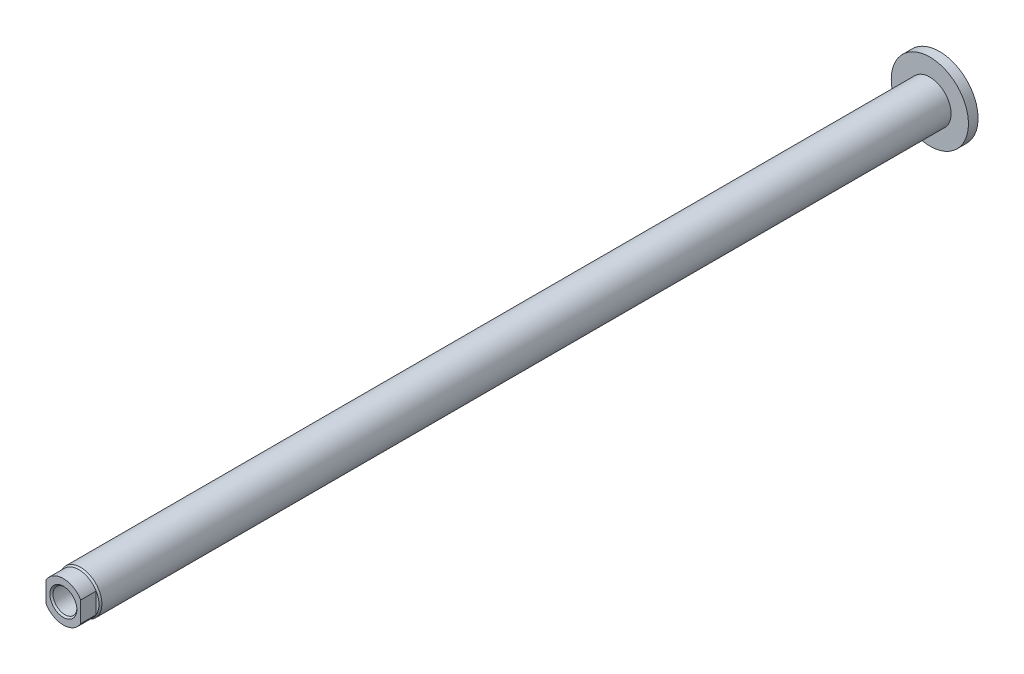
ISO-10303-21;
HEADER;
FILE_DESCRIPTION(('STEP AP214'),'2;1');
FILE_NAME('part.step','',(''),(''),'','','');
FILE_SCHEMA(('AUTOMOTIVE_DESIGN { 1 0 10303 214 1 1 1 1 }'));
ENDSEC;
DATA;
#1=APPLICATION_CONTEXT('core data for automotive mechanical design processes');
#2=APPLICATION_PROTOCOL_DEFINITION('international standard','automotive_design',2000,#1);
#3=PRODUCT_CONTEXT('',#1,'mechanical');
#4=PRODUCT('Part','Part','',(#3));
#5=PRODUCT_RELATED_PRODUCT_CATEGORY('part','',(#4));
#6=PRODUCT_DEFINITION_FORMATION('','',#4);
#7=PRODUCT_DEFINITION_CONTEXT('part definition',#1,'design');
#8=PRODUCT_DEFINITION('design','',#6,#7);
#9=PRODUCT_DEFINITION_SHAPE('','',#8);
#10=(LENGTH_UNIT() NAMED_UNIT(*) SI_UNIT(.MILLI.,.METRE.));
#11=(NAMED_UNIT(*) PLANE_ANGLE_UNIT() SI_UNIT($,.RADIAN.));
#12=(NAMED_UNIT(*) SI_UNIT($,.STERADIAN.) SOLID_ANGLE_UNIT());
#13=UNCERTAINTY_MEASURE_WITH_UNIT(LENGTH_MEASURE(1.E-05),#10,'distance_accuracy_value','');
#14=(GEOMETRIC_REPRESENTATION_CONTEXT(3) GLOBAL_UNCERTAINTY_ASSIGNED_CONTEXT((#13)) GLOBAL_UNIT_ASSIGNED_CONTEXT((#10,
#11,#12)) REPRESENTATION_CONTEXT('',''));
#15=CARTESIAN_POINT('',(0.,0.,0.));
#16=DIRECTION('',(0.,0.,1.));
#17=DIRECTION('',(1.,0.,0.));
#18=AXIS2_PLACEMENT_3D('',#15,#16,#17);
#19=CARTESIAN_POINT('',(0.,5.5,-435.));
#20=DIRECTION('',(0.,0.,-1.));
#21=DIRECTION('',(0.,1.,0.));
#22=AXIS2_PLACEMENT_3D('',#19,#20,#21);
#23=PLANE('',#22);
#24=CARTESIAN_POINT('',(0.,0.,-435.));
#25=DIRECTION('',(0.,0.,-1.));
#26=DIRECTION('',(-1.,0.,0.));
#27=AXIS2_PLACEMENT_3D('',#24,#25,#26);
#28=CIRCLE('',#27,20.);
#29=CARTESIAN_POINT('',(-20.,0.,-435.));
#30=VERTEX_POINT('',#29);
#31=EDGE_CURVE('E153',#30,#30,#28,.T.);
#32=ORIENTED_EDGE('',*,*,#31,.T.);
#33=EDGE_LOOP('',(#32));
#34=FACE_BOUND('',#33,.T.);
#35=ADVANCED_FACE('F15',(#34),#23,.T.);
#36=CARTESIAN_POINT('',(0.,0.,-212.476313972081));
#37=DIRECTION('',(0.,0.,1.));
#38=DIRECTION('',(0.,1.,0.));
#39=AXIS2_PLACEMENT_3D('',#36,#37,#38);
#40=CYLINDRICAL_SURFACE('',#39,11.);
#41=CARTESIAN_POINT('',(0.,0.,10.0473720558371));
#42=DIRECTION('',(0.,0.,-1.));
#43=DIRECTION('',(0.,1.,0.));
#44=AXIS2_PLACEMENT_3D('',#41,#42,#43);
#45=CIRCLE('',#44,11.);
#46=CARTESIAN_POINT('',(0.,11.,10.0473720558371));
#47=VERTEX_POINT('',#46);
#48=EDGE_CURVE('E10',#47,#47,#45,.T.);
#49=ORIENTED_EDGE('',*,*,#48,.T.);
#50=EDGE_LOOP('',(#49));
#51=FACE_BOUND('',#50,.T.);
#52=CARTESIAN_POINT('',(0.,0.,-430.));
#53=DIRECTION('',(0.,0.,1.));
#54=DIRECTION('',(0.,1.,0.));
#55=AXIS2_PLACEMENT_3D('',#52,#53,#54);
#56=CIRCLE('',#55,11.);
#57=CARTESIAN_POINT('',(0.,-11.,-430.));
#58=VERTEX_POINT('',#57);
#59=EDGE_CURVE('E178',#58,#58,#56,.T.);
#60=ORIENTED_EDGE('',*,*,#59,.T.);
#61=EDGE_LOOP('',(#60));
#62=FACE_BOUND('',#61,.T.);
#63=ADVANCED_FACE('F108',(#51,#62),#40,.T.);
#64=CARTESIAN_POINT('',(0.,0.,10.5236860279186));
#65=DIRECTION('',(0.,0.,-1.));
#66=DIRECTION('',(0.,1.,0.));
#67=AXIS2_PLACEMENT_3D('',#64,#65,#66);
#68=CONICAL_SURFACE('',#67,10.725,0.523598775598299);
#69=CARTESIAN_POINT('',(0.,0.,11.));
#70=DIRECTION('',(0.,0.,-1.));
#71=DIRECTION('',(0.,1.,0.));
#72=AXIS2_PLACEMENT_3D('',#69,#70,#71);
#73=CIRCLE('',#72,10.45);
#74=CARTESIAN_POINT('',(9.,-5.31060260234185,11.));
#75=VERTEX_POINT('',#74);
#76=CARTESIAN_POINT('',(-9.,-5.31060260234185,11.));
#77=VERTEX_POINT('',#76);
#78=EDGE_CURVE('E25',#75,#77,#73,.T.);
#79=ORIENTED_EDGE('',*,*,#78,.T.);
#80=CARTESIAN_POINT('',(0.,0.,11.));
#81=DIRECTION('',(0.,0.,-1.));
#82=DIRECTION('',(0.,1.,0.));
#83=AXIS2_PLACEMENT_3D('',#80,#81,#82);
#84=CIRCLE('',#83,10.45);
#85=CARTESIAN_POINT('',(-9.,5.31060260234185,11.));
#86=VERTEX_POINT('',#85);
#87=EDGE_CURVE('E181',#77,#86,#84,.T.);
#88=ORIENTED_EDGE('',*,*,#87,.T.);
#89=CARTESIAN_POINT('',(0.,0.,11.));
#90=DIRECTION('',(0.,0.,-1.));
#91=DIRECTION('',(0.,1.,0.));
#92=AXIS2_PLACEMENT_3D('',#89,#90,#91);
#93=CIRCLE('',#92,10.45);
#94=CARTESIAN_POINT('',(9.,5.31060260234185,11.));
#95=VERTEX_POINT('',#94);
#96=EDGE_CURVE('E143',#86,#95,#93,.T.);
#97=ORIENTED_EDGE('',*,*,#96,.T.);
#98=CARTESIAN_POINT('',(0.,0.,11.));
#99=DIRECTION('',(0.,0.,-1.));
#100=DIRECTION('',(0.,1.,0.));
#101=AXIS2_PLACEMENT_3D('',#98,#99,#100);
#102=CIRCLE('',#101,10.45);
#103=EDGE_CURVE('E165',#95,#75,#102,.T.);
#104=ORIENTED_EDGE('',*,*,#103,.T.);
#105=EDGE_LOOP('',(#79,#88,#97,#104));
#106=FACE_BOUND('',#105,.T.);
#107=ORIENTED_EDGE('',*,*,#48,.F.);
#108=EDGE_LOOP('',(#107));
#109=FACE_BOUND('',#108,.T.);
#110=ADVANCED_FACE('F114',(#106,#109),#68,.T.);
#111=CARTESIAN_POINT('',(0.,0.,15.));
#112=DIRECTION('',(0.,0.,1.));
#113=DIRECTION('',(0.,1.,0.));
#114=AXIS2_PLACEMENT_3D('',#111,#112,#113);
#115=CYLINDRICAL_SURFACE('',#114,10.45);
#116=DIRECTION('',(0.,0.,-1.));
#117=VECTOR('',#116,1.);
#118=CARTESIAN_POINT('',(-9.,-5.31060260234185,15.));
#119=LINE('',#118,#117);
#120=CARTESIAN_POINT('',(-9.,-5.31060260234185,19.));
#121=VERTEX_POINT('',#120);
#122=EDGE_CURVE('E19',#121,#77,#119,.T.);
#123=ORIENTED_EDGE('',*,*,#122,.T.);
#124=ORIENTED_EDGE('',*,*,#78,.F.);
#125=DIRECTION('',(0.,0.,1.));
#126=VECTOR('',#125,1.);
#127=CARTESIAN_POINT('',(9.,-5.31060260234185,15.));
#128=LINE('',#127,#126);
#129=CARTESIAN_POINT('',(9.,-5.31060260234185,19.));
#130=VERTEX_POINT('',#129);
#131=EDGE_CURVE('E179',#75,#130,#128,.T.);
#132=ORIENTED_EDGE('',*,*,#131,.T.);
#133=CARTESIAN_POINT('',(0.,0.,19.));
#134=DIRECTION('',(0.,0.,-1.));
#135=DIRECTION('',(0.,1.,0.));
#136=AXIS2_PLACEMENT_3D('',#133,#134,#135);
#137=CIRCLE('',#136,10.45);
#138=EDGE_CURVE('E56',#130,#121,#137,.T.);
#139=ORIENTED_EDGE('',*,*,#138,.T.);
#140=EDGE_LOOP('',(#123,#124,#132,#139));
#141=FACE_BOUND('',#140,.T.);
#142=ADVANCED_FACE('F102',(#141),#115,.T.);
#143=CARTESIAN_POINT('',(0.,5.225,19.));
#144=DIRECTION('',(0.,0.,1.));
#145=DIRECTION('',(0.,-1.,0.));
#146=AXIS2_PLACEMENT_3D('',#143,#144,#145);
#147=PLANE('',#146);
#148=CARTESIAN_POINT('',(0.,0.,19.));
#149=DIRECTION('',(0.,0.,-1.));
#150=DIRECTION('',(0.,1.,0.));
#151=AXIS2_PLACEMENT_3D('',#148,#149,#150);
#152=CIRCLE('',#151,7.);
#153=CARTESIAN_POINT('',(0.,7.,19.));
#154=VERTEX_POINT('',#153);
#155=EDGE_CURVE('E166',#154,#154,#152,.T.);
#156=ORIENTED_EDGE('',*,*,#155,.T.);
#157=EDGE_LOOP('',(#156));
#158=FACE_BOUND('',#157,.T.);
#159=DIRECTION('',(0.,-1.,0.));
#160=VECTOR('',#159,1.);
#161=CARTESIAN_POINT('',(-9.,2.6125,19.));
#162=LINE('',#161,#160);
#163=CARTESIAN_POINT('',(-9.,5.31060260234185,19.));
#164=VERTEX_POINT('',#163);
#165=EDGE_CURVE('E146',#164,#121,#162,.T.);
#166=ORIENTED_EDGE('',*,*,#165,.T.);
#167=ORIENTED_EDGE('',*,*,#138,.F.);
#168=DIRECTION('',(0.,1.,0.));
#169=VECTOR('',#168,1.);
#170=CARTESIAN_POINT('',(9.,2.6125,19.));
#171=LINE('',#170,#169);
#172=CARTESIAN_POINT('',(9.,5.31060260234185,19.));
#173=VERTEX_POINT('',#172);
#174=EDGE_CURVE('E164',#130,#173,#171,.T.);
#175=ORIENTED_EDGE('',*,*,#174,.T.);
#176=CARTESIAN_POINT('',(0.,0.,19.));
#177=DIRECTION('',(0.,0.,-1.));
#178=DIRECTION('',(0.,1.,0.));
#179=AXIS2_PLACEMENT_3D('',#176,#177,#178);
#180=CIRCLE('',#179,10.45);
#181=EDGE_CURVE('E45',#164,#173,#180,.T.);
#182=ORIENTED_EDGE('',*,*,#181,.F.);
#183=EDGE_LOOP('',(#166,#167,#175,#182));
#184=FACE_BOUND('',#183,.T.);
#185=ADVANCED_FACE('F17',(#158,#184),#147,.T.);
#186=CARTESIAN_POINT('',(0.,0.,-10.2863578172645));
#187=DIRECTION('',(0.,0.,1.));
#188=DIRECTION('',(0.,1.,0.));
#189=AXIS2_PLACEMENT_3D('',#186,#187,#188);
#190=CONICAL_SURFACE('',#189,3.0940625,1.0471975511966);
#191=CARTESIAN_POINT('',(0.,0.,-8.5));
#192=DIRECTION('',(0.,0.,-1.));
#193=DIRECTION('',(0.,1.,0.));
#194=AXIS2_PLACEMENT_3D('',#191,#192,#193);
#195=CIRCLE('',#194,6.188125);
#196=CARTESIAN_POINT('',(0.,6.188125,-8.5));
#197=VERTEX_POINT('',#196);
#198=EDGE_CURVE('E159',#197,#197,#195,.T.);
#199=ORIENTED_EDGE('',*,*,#198,.F.);
#200=EDGE_LOOP('',(#199));
#201=FACE_BOUND('',#200,.T.);
#202=CARTESIAN_POINT('',(0.,0.,-12.0727156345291));
#203=VERTEX_POINT('',#202);
#204=VERTEX_LOOP('',#203);
#205=FACE_BOUND('',#204,.T.);
#206=ADVANCED_FACE('F89',(#201,#205),#190,.F.);
#207=CARTESIAN_POINT('',(0.,0.,-7.6559375));
#208=DIRECTION('',(0.,0.,1.));
#209=DIRECTION('',(0.,1.,0.));
#210=AXIS2_PLACEMENT_3D('',#207,#208,#209);
#211=CYLINDRICAL_SURFACE('',#210,6.188125);
#212=CARTESIAN_POINT('',(0.,0.,-6.811875));
#213=DIRECTION('',(0.,0.,-1.));
#214=DIRECTION('',(0.,1.,0.));
#215=AXIS2_PLACEMENT_3D('',#212,#213,#214);
#216=CIRCLE('',#215,6.188125);
#217=CARTESIAN_POINT('',(0.,6.188125,-6.811875));
#218=VERTEX_POINT('',#217);
#219=EDGE_CURVE('E156',#218,#218,#216,.T.);
#220=ORIENTED_EDGE('',*,*,#219,.F.);
#221=EDGE_LOOP('',(#220));
#222=FACE_BOUND('',#221,.T.);
#223=ORIENTED_EDGE('',*,*,#198,.T.);
#224=EDGE_LOOP('',(#223));
#225=FACE_BOUND('',#224,.T.);
#226=ADVANCED_FACE('F91',(#222,#225),#211,.F.);
#227=CARTESIAN_POINT('',(0.,0.,-6.4059375));
#228=DIRECTION('',(0.,0.,1.));
#229=DIRECTION('',(0.,1.,0.));
#230=AXIS2_PLACEMENT_3D('',#227,#228,#229);
#231=CONICAL_SURFACE('',#230,6.5940625,0.785398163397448);
#232=CARTESIAN_POINT('',(0.,0.,-6.));
#233=DIRECTION('',(0.,0.,-1.));
#234=DIRECTION('',(0.,1.,0.));
#235=AXIS2_PLACEMENT_3D('',#232,#233,#234);
#236=CIRCLE('',#235,7.);
#237=CARTESIAN_POINT('',(0.,7.,-6.));
#238=VERTEX_POINT('',#237);
#239=EDGE_CURVE('E154',#238,#238,#236,.T.);
#240=ORIENTED_EDGE('',*,*,#239,.F.);
#241=EDGE_LOOP('',(#240));
#242=FACE_BOUND('',#241,.T.);
#243=ORIENTED_EDGE('',*,*,#219,.T.);
#244=EDGE_LOOP('',(#243));
#245=FACE_BOUND('',#244,.T.);
#246=ADVANCED_FACE('F99',(#242,#245),#231,.F.);
#247=CARTESIAN_POINT('',(0.,6.5940625,-6.));
#248=DIRECTION('',(0.,0.,1.));
#249=DIRECTION('',(0.,-1.,0.));
#250=AXIS2_PLACEMENT_3D('',#247,#248,#249);
#251=PLANE('',#250);
#252=CARTESIAN_POINT('',(0.,0.,-6.));
#253=DIRECTION('',(0.,0.,-1.));
#254=DIRECTION('',(0.,1.,0.));
#255=AXIS2_PLACEMENT_3D('',#252,#253,#254);
#256=CIRCLE('',#255,6.188125);
#257=CARTESIAN_POINT('',(0.,6.188125,-6.));
#258=VERTEX_POINT('',#257);
#259=EDGE_CURVE('E157',#258,#258,#256,.T.);
#260=ORIENTED_EDGE('',*,*,#259,.F.);
#261=EDGE_LOOP('',(#260));
#262=FACE_BOUND('',#261,.T.);
#263=ORIENTED_EDGE('',*,*,#239,.T.);
#264=EDGE_LOOP('',(#263));
#265=FACE_BOUND('',#264,.T.);
#266=ADVANCED_FACE('F120',(#262,#265),#251,.F.);
#267=CARTESIAN_POINT('',(0.,0.,6.0940625));
#268=DIRECTION('',(0.,0.,1.));
#269=DIRECTION('',(0.,1.,0.));
#270=AXIS2_PLACEMENT_3D('',#267,#268,#269);
#271=CYLINDRICAL_SURFACE('',#270,6.188125);
#272=CARTESIAN_POINT('',(0.,0.,18.188125));
#273=DIRECTION('',(0.,0.,-1.));
#274=DIRECTION('',(0.,1.,0.));
#275=AXIS2_PLACEMENT_3D('',#272,#273,#274);
#276=CIRCLE('',#275,6.188125);
#277=CARTESIAN_POINT('',(0.,6.188125,18.188125));
#278=VERTEX_POINT('',#277);
#279=EDGE_CURVE('E168',#278,#278,#276,.T.);
#280=ORIENTED_EDGE('',*,*,#279,.F.);
#281=EDGE_LOOP('',(#280));
#282=FACE_BOUND('',#281,.T.);
#283=ORIENTED_EDGE('',*,*,#259,.T.);
#284=EDGE_LOOP('',(#283));
#285=FACE_BOUND('',#284,.T.);
#286=ADVANCED_FACE('F122',(#282,#285),#271,.F.);
#287=CARTESIAN_POINT('',(0.,0.,18.5940625));
#288=DIRECTION('',(0.,0.,1.));
#289=DIRECTION('',(0.,1.,0.));
#290=AXIS2_PLACEMENT_3D('',#287,#288,#289);
#291=CONICAL_SURFACE('',#290,6.5940625,0.785398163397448);
#292=ORIENTED_EDGE('',*,*,#155,.F.);
#293=EDGE_LOOP('',(#292));
#294=FACE_BOUND('',#293,.T.);
#295=ORIENTED_EDGE('',*,*,#279,.T.);
#296=EDGE_LOOP('',(#295));
#297=FACE_BOUND('',#296,.T.);
#298=ADVANCED_FACE('F220',(#294,#297),#291,.F.);
#299=CARTESIAN_POINT('',(0.,0.,-432.5));
#300=DIRECTION('',(0.,0.,1.));
#301=DIRECTION('',(-1.,0.,0.));
#302=AXIS2_PLACEMENT_3D('',#299,#300,#301);
#303=CYLINDRICAL_SURFACE('',#302,20.);
#304=ORIENTED_EDGE('',*,*,#31,.F.);
#305=EDGE_LOOP('',(#304));
#306=FACE_BOUND('',#305,.T.);
#307=CARTESIAN_POINT('',(0.,0.,-430.));
#308=DIRECTION('',(0.,0.,1.));
#309=DIRECTION('',(-1.,0.,0.));
#310=AXIS2_PLACEMENT_3D('',#307,#308,#309);
#311=CIRCLE('',#310,20.);
#312=CARTESIAN_POINT('',(-20.,0.,-430.));
#313=VERTEX_POINT('',#312);
#314=EDGE_CURVE('E176',#313,#313,#311,.T.);
#315=ORIENTED_EDGE('',*,*,#314,.F.);
#316=EDGE_LOOP('',(#315));
#317=FACE_BOUND('',#316,.T.);
#318=ADVANCED_FACE('F204',(#306,#317),#303,.T.);
#319=CARTESIAN_POINT('',(0.,0.,-430.));
#320=DIRECTION('',(0.,0.,1.));
#321=DIRECTION('',(1.,0.,0.));
#322=AXIS2_PLACEMENT_3D('',#319,#320,#321);
#323=PLANE('',#322);
#324=ORIENTED_EDGE('',*,*,#59,.F.);
#325=EDGE_LOOP('',(#324));
#326=FACE_BOUND('',#325,.T.);
#327=ORIENTED_EDGE('',*,*,#314,.T.);
#328=EDGE_LOOP('',(#327));
#329=FACE_BOUND('',#328,.T.);
#330=ADVANCED_FACE('F199',(#326,#329),#323,.T.);
#331=CARTESIAN_POINT('',(9.,0.,15.5));
#332=DIRECTION('',(1.,0.,0.));
#333=DIRECTION('',(0.,0.,-1.));
#334=AXIS2_PLACEMENT_3D('',#331,#332,#333);
#335=PLANE('',#334);
#336=DIRECTION('',(0.,0.,-1.));
#337=VECTOR('',#336,1.);
#338=CARTESIAN_POINT('',(9.,5.31060260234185,15.));
#339=LINE('',#338,#337);
#340=EDGE_CURVE('E169',#173,#95,#339,.T.);
#341=ORIENTED_EDGE('',*,*,#340,.F.);
#342=ORIENTED_EDGE('',*,*,#174,.F.);
#343=ORIENTED_EDGE('',*,*,#131,.F.);
#344=DIRECTION('',(0.,-1.,0.));
#345=VECTOR('',#344,1.);
#346=CARTESIAN_POINT('',(9.,0.,11.));
#347=LINE('',#346,#345);
#348=EDGE_CURVE('E161',#95,#75,#347,.T.);
#349=ORIENTED_EDGE('',*,*,#348,.F.);
#350=EDGE_LOOP('',(#341,#342,#343,#349));
#351=FACE_BOUND('',#350,.T.);
#352=ADVANCED_FACE('F135',(#351),#335,.T.);
#353=CARTESIAN_POINT('',(20.,0.,11.));
#354=DIRECTION('',(0.,0.,1.));
#355=DIRECTION('',(1.,0.,0.));
#356=AXIS2_PLACEMENT_3D('',#353,#354,#355);
#357=PLANE('',#356);
#358=ORIENTED_EDGE('',*,*,#103,.F.);
#359=ORIENTED_EDGE('',*,*,#348,.T.);
#360=EDGE_LOOP('',(#358,#359));
#361=FACE_BOUND('',#360,.T.);
#362=ADVANCED_FACE('F127',(#361),#357,.T.);
#363=CARTESIAN_POINT('',(0.,0.,15.));
#364=DIRECTION('',(0.,0.,1.));
#365=DIRECTION('',(0.,1.,0.));
#366=AXIS2_PLACEMENT_3D('',#363,#364,#365);
#367=CYLINDRICAL_SURFACE('',#366,10.45);
#368=DIRECTION('',(0.,0.,1.));
#369=VECTOR('',#368,1.);
#370=CARTESIAN_POINT('',(-9.,5.31060260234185,15.));
#371=LINE('',#370,#369);
#372=EDGE_CURVE('E139',#86,#164,#371,.T.);
#373=ORIENTED_EDGE('',*,*,#372,.T.);
#374=ORIENTED_EDGE('',*,*,#181,.T.);
#375=ORIENTED_EDGE('',*,*,#340,.T.);
#376=ORIENTED_EDGE('',*,*,#96,.F.);
#377=EDGE_LOOP('',(#373,#374,#375,#376));
#378=FACE_BOUND('',#377,.T.);
#379=ADVANCED_FACE('F124',(#378),#367,.T.);
#380=CARTESIAN_POINT('',(-9.,0.,15.5));
#381=DIRECTION('',(-1.,0.,0.));
#382=DIRECTION('',(0.,0.,-1.));
#383=AXIS2_PLACEMENT_3D('',#380,#381,#382);
#384=PLANE('',#383);
#385=ORIENTED_EDGE('',*,*,#122,.F.);
#386=ORIENTED_EDGE('',*,*,#165,.F.);
#387=ORIENTED_EDGE('',*,*,#372,.F.);
#388=DIRECTION('',(0.,1.,0.));
#389=VECTOR('',#388,1.);
#390=CARTESIAN_POINT('',(-9.,0.,11.));
#391=LINE('',#390,#389);
#392=EDGE_CURVE('E150',#77,#86,#391,.T.);
#393=ORIENTED_EDGE('',*,*,#392,.F.);
#394=EDGE_LOOP('',(#385,#386,#387,#393));
#395=FACE_BOUND('',#394,.T.);
#396=ADVANCED_FACE('F126',(#395),#384,.T.);
#397=CARTESIAN_POINT('',(-20.,0.,11.));
#398=DIRECTION('',(0.,0.,1.));
#399=DIRECTION('',(-1.,0.,0.));
#400=AXIS2_PLACEMENT_3D('',#397,#398,#399);
#401=PLANE('',#400);
#402=ORIENTED_EDGE('',*,*,#87,.F.);
#403=ORIENTED_EDGE('',*,*,#392,.T.);
#404=EDGE_LOOP('',(#402,#403));
#405=FACE_BOUND('',#404,.T.);
#406=ADVANCED_FACE('F133',(#405),#401,.T.);
#407=CLOSED_SHELL('',(#35,#63,#110,#142,#185,#206,#226,#246,#266,#286,#298,#318,#330,#352,#362,
#379,#396,#406));
#408=MANIFOLD_SOLID_BREP('B1',#407);
#409=ADVANCED_BREP_SHAPE_REPRESENTATION('',(#18,#408),#14);
#410=SHAPE_DEFINITION_REPRESENTATION(#9,#409);
ENDSEC;
END-ISO-10303-21;
